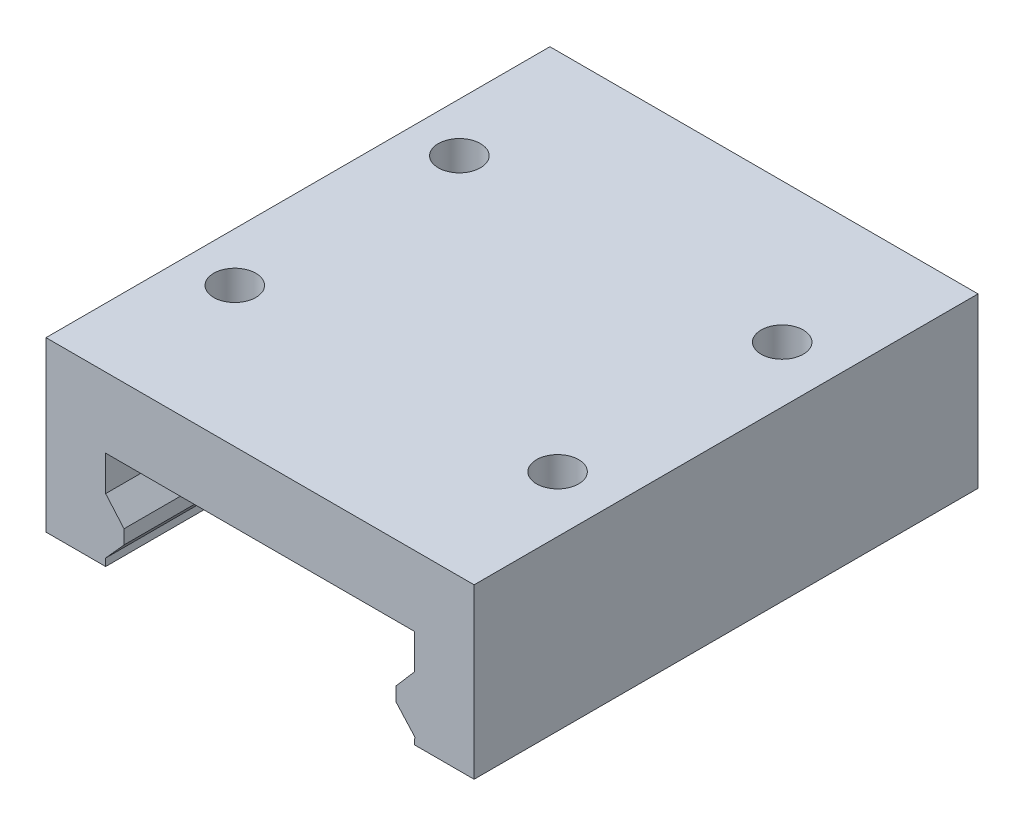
ISO-10303-21;
HEADER;
FILE_DESCRIPTION(('STEP AP214'),'2;1');
FILE_NAME('part.step','',(''),(''),'','','');
FILE_SCHEMA(('AUTOMOTIVE_DESIGN { 1 0 10303 214 1 1 1 1 }'));
ENDSEC;
DATA;
#1=APPLICATION_CONTEXT('core data for automotive mechanical design processes');
#2=APPLICATION_PROTOCOL_DEFINITION('international standard','automotive_design',2000,#1);
#3=PRODUCT_CONTEXT('',#1,'mechanical');
#4=PRODUCT('Part','Part','',(#3));
#5=PRODUCT_RELATED_PRODUCT_CATEGORY('part','',(#4));
#6=PRODUCT_DEFINITION_FORMATION('','',#4);
#7=PRODUCT_DEFINITION_CONTEXT('part definition',#1,'design');
#8=PRODUCT_DEFINITION('design','',#6,#7);
#9=PRODUCT_DEFINITION_SHAPE('','',#8);
#10=(LENGTH_UNIT() NAMED_UNIT(*) SI_UNIT(.MILLI.,.METRE.));
#11=(NAMED_UNIT(*) PLANE_ANGLE_UNIT() SI_UNIT($,.RADIAN.));
#12=(NAMED_UNIT(*) SI_UNIT($,.STERADIAN.) SOLID_ANGLE_UNIT());
#13=UNCERTAINTY_MEASURE_WITH_UNIT(LENGTH_MEASURE(1.E-05),#10,'distance_accuracy_value','');
#14=(GEOMETRIC_REPRESENTATION_CONTEXT(3) GLOBAL_UNCERTAINTY_ASSIGNED_CONTEXT((#13)) GLOBAL_UNIT_ASSIGNED_CONTEXT((#10,
#11,#12)) REPRESENTATION_CONTEXT('',''));
#15=CARTESIAN_POINT('',(0.,0.,0.));
#16=DIRECTION('',(0.,0.,1.));
#17=DIRECTION('',(1.,0.,0.));
#18=AXIS2_PLACEMENT_3D('',#15,#16,#17);
#19=CARTESIAN_POINT('',(0.,3.,71.8));
#20=DIRECTION('',(0.,-1.,0.));
#21=DIRECTION('',(0.,0.,-1.));
#22=AXIS2_PLACEMENT_3D('',#19,#20,#21);
#23=PLANE('',#22);
#24=DIRECTION('',(-1.,0.,0.));
#25=VECTOR('',#24,1.);
#26=CARTESIAN_POINT('',(0.,3.,0.));
#27=LINE('',#26,#25);
#28=CARTESIAN_POINT('',(-22.,3.,0.));
#29=VERTEX_POINT('',#28);
#30=CARTESIAN_POINT('',(-30.5,3.,0.));
#31=VERTEX_POINT('',#30);
#32=EDGE_CURVE('E372',#29,#31,#27,.T.);
#33=ORIENTED_EDGE('',*,*,#32,.F.);
#34=DIRECTION('',(0.,0.,-1.));
#35=VECTOR('',#34,1.);
#36=CARTESIAN_POINT('',(-22.,3.,71.8));
#37=LINE('',#36,#35);
#38=CARTESIAN_POINT('',(-22.,3.,71.8));
#39=VERTEX_POINT('',#38);
#40=EDGE_CURVE('E394',#39,#29,#37,.T.);
#41=ORIENTED_EDGE('',*,*,#40,.F.);
#42=DIRECTION('',(-1.,0.,0.));
#43=VECTOR('',#42,1.);
#44=CARTESIAN_POINT('',(0.,3.,71.8));
#45=LINE('',#44,#43);
#46=CARTESIAN_POINT('',(-30.5,3.,71.8));
#47=VERTEX_POINT('',#46);
#48=EDGE_CURVE('E438',#39,#47,#45,.T.);
#49=ORIENTED_EDGE('',*,*,#48,.T.);
#50=DIRECTION('',(0.,0.,-1.));
#51=VECTOR('',#50,1.);
#52=CARTESIAN_POINT('',(-30.5,3.,71.8));
#53=LINE('',#52,#51);
#54=EDGE_CURVE('E396',#47,#31,#53,.T.);
#55=ORIENTED_EDGE('',*,*,#54,.T.);
#56=EDGE_LOOP('',(#33,#41,#49,#55));
#57=FACE_BOUND('',#56,.T.);
#58=ADVANCED_FACE('F121',(#57),#23,.T.);
#59=CARTESIAN_POINT('',(0.,-36.1285275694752,0.));
#60=DIRECTION('',(0.,0.,1.));
#61=DIRECTION('',(1.,0.,0.));
#62=AXIS2_PLACEMENT_3D('',#59,#60,#61);
#63=PLANE('',#62);
#64=DIRECTION('',(0.,1.,0.));
#65=VECTOR('',#64,1.);
#66=CARTESIAN_POINT('',(-22.,-36.1285275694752,0.));
#67=LINE('',#66,#65);
#68=CARTESIAN_POINT('',(-22.,11.9999999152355,0.));
#69=VERTEX_POINT('',#68);
#70=CARTESIAN_POINT('',(-22.,16.9999999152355,0.));
#71=VERTEX_POINT('',#70);
#72=EDGE_CURVE('E254',#69,#71,#67,.T.);
#73=ORIENTED_EDGE('',*,*,#72,.F.);
#74=DIRECTION('',(-0.654424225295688,0.756127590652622,0.));
#75=VECTOR('',#74,1.);
#76=CARTESIAN_POINT('',(11.2373167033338,-26.4026924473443,0.));
#77=LINE('',#76,#75);
#78=CARTESIAN_POINT('',(-19.3823030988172,8.975489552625,0.));
#79=VERTEX_POINT('',#78);
#80=EDGE_CURVE('E381',#79,#69,#77,.T.);
#81=ORIENTED_EDGE('',*,*,#80,.F.);
#82=DIRECTION('',(0.,1.,0.));
#83=VECTOR('',#82,1.);
#84=CARTESIAN_POINT('',(-19.3823030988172,-36.1285275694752,0.));
#85=LINE('',#84,#83);
#86=CARTESIAN_POINT('',(-19.3823030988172,6.975489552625,0.));
#87=VERTEX_POINT('',#86);
#88=EDGE_CURVE('E379',#87,#79,#85,.T.);
#89=ORIENTED_EDGE('',*,*,#88,.F.);
#90=DIRECTION('',(0.66791595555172,0.744236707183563,0.));
#91=VECTOR('',#90,1.);
#92=CARTESIAN_POINT('',(-32.1621016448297,-7.26461821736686,0.));
#93=LINE('',#92,#91);
#94=CARTESIAN_POINT('',(-22.0539669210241,3.99854272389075,0.));
#95=VERTEX_POINT('',#94);
#96=EDGE_CURVE('E377',#95,#87,#93,.T.);
#97=ORIENTED_EDGE('',*,*,#96,.F.);
#98=DIRECTION('',(-0.0539669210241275,0.998542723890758,0.));
#99=VECTOR('',#98,1.);
#100=CARTESIAN_POINT('',(-19.8273576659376,-37.2001106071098,0.));
#101=LINE('',#100,#99);
#102=EDGE_CURVE('E375',#29,#95,#101,.T.);
#103=ORIENTED_EDGE('',*,*,#102,.F.);
#104=ORIENTED_EDGE('',*,*,#32,.T.);
#105=DIRECTION('',(0.,1.,0.));
#106=VECTOR('',#105,1.);
#107=CARTESIAN_POINT('',(-30.5,-36.1285275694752,0.));
#108=LINE('',#107,#106);
#109=CARTESIAN_POINT('',(-30.5,27.,0.));
#110=VERTEX_POINT('',#109);
#111=EDGE_CURVE('E369',#31,#110,#108,.T.);
#112=ORIENTED_EDGE('',*,*,#111,.T.);
#113=DIRECTION('',(1.,0.,0.));
#114=VECTOR('',#113,1.);
#115=CARTESIAN_POINT('',(0.,27.,0.));
#116=LINE('',#115,#114);
#117=CARTESIAN_POINT('',(30.5,27.,0.));
#118=VERTEX_POINT('',#117);
#119=EDGE_CURVE('E238',#110,#118,#116,.T.);
#120=ORIENTED_EDGE('',*,*,#119,.T.);
#121=DIRECTION('',(0.,1.,0.));
#122=VECTOR('',#121,1.);
#123=CARTESIAN_POINT('',(30.5,3.,0.));
#124=LINE('',#123,#122);
#125=CARTESIAN_POINT('',(30.5,3.,0.));
#126=VERTEX_POINT('',#125);
#127=EDGE_CURVE('E285',#126,#118,#124,.T.);
#128=ORIENTED_EDGE('',*,*,#127,.F.);
#129=DIRECTION('',(1.,0.,0.));
#130=VECTOR('',#129,1.);
#131=CARTESIAN_POINT('',(22.,3.,0.));
#132=LINE('',#131,#130);
#133=CARTESIAN_POINT('',(22.,3.,0.));
#134=VERTEX_POINT('',#133);
#135=EDGE_CURVE('E287',#134,#126,#132,.T.);
#136=ORIENTED_EDGE('',*,*,#135,.F.);
#137=DIRECTION('',(0.0539669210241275,0.998542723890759,0.));
#138=VECTOR('',#137,1.);
#139=CARTESIAN_POINT('',(22.,3.,0.));
#140=LINE('',#139,#138);
#141=CARTESIAN_POINT('',(22.0539669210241,3.99854272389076,0.));
#142=VERTEX_POINT('',#141);
#143=EDGE_CURVE('E290',#134,#142,#140,.T.);
#144=ORIENTED_EDGE('',*,*,#143,.T.);
#145=DIRECTION('',(-0.667915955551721,0.744236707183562,0.));
#146=VECTOR('',#145,1.);
#147=CARTESIAN_POINT('',(22.0539669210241,3.99854272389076,0.));
#148=LINE('',#147,#146);
#149=CARTESIAN_POINT('',(19.3823030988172,6.975489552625,0.));
#150=VERTEX_POINT('',#149);
#151=EDGE_CURVE('E293',#142,#150,#148,.T.);
#152=ORIENTED_EDGE('',*,*,#151,.T.);
#153=DIRECTION('',(0.,1.,0.));
#154=VECTOR('',#153,1.);
#155=CARTESIAN_POINT('',(19.3823030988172,6.975489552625,0.));
#156=LINE('',#155,#154);
#157=CARTESIAN_POINT('',(19.3823030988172,8.975489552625,0.));
#158=VERTEX_POINT('',#157);
#159=EDGE_CURVE('E296',#150,#158,#156,.T.);
#160=ORIENTED_EDGE('',*,*,#159,.T.);
#161=DIRECTION('',(0.654424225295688,0.756127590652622,0.));
#162=VECTOR('',#161,1.);
#163=CARTESIAN_POINT('',(19.3823030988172,8.975489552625,0.));
#164=LINE('',#163,#162);
#165=CARTESIAN_POINT('',(22.,11.9999999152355,0.));
#166=VERTEX_POINT('',#165);
#167=EDGE_CURVE('E249',#158,#166,#164,.T.);
#168=ORIENTED_EDGE('',*,*,#167,.T.);
#169=DIRECTION('',(0.,1.,0.));
#170=VECTOR('',#169,1.);
#171=CARTESIAN_POINT('',(22.,11.9999999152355,0.));
#172=LINE('',#171,#170);
#173=CARTESIAN_POINT('',(22.,16.9999999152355,0.));
#174=VERTEX_POINT('',#173);
#175=EDGE_CURVE('E243',#166,#174,#172,.T.);
#176=ORIENTED_EDGE('',*,*,#175,.T.);
#177=DIRECTION('',(-0.999999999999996,8.4764507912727E-08,0.));
#178=VECTOR('',#177,1.);
#179=CARTESIAN_POINT('',(22.,16.9999999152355,0.));
#180=LINE('',#179,#178);
#181=CARTESIAN_POINT('',(21.,17.,0.));
#182=VERTEX_POINT('',#181);
#183=EDGE_CURVE('E234',#174,#182,#180,.T.);
#184=ORIENTED_EDGE('',*,*,#183,.T.);
#185=DIRECTION('',(-1.,0.,0.));
#186=VECTOR('',#185,1.);
#187=CARTESIAN_POINT('',(0.,17.,0.));
#188=LINE('',#187,#186);
#189=CARTESIAN_POINT('',(-21.,17.,0.));
#190=VERTEX_POINT('',#189);
#191=EDGE_CURVE('E231',#182,#190,#188,.T.);
#192=ORIENTED_EDGE('',*,*,#191,.T.);
#193=DIRECTION('',(0.999999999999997,8.47645044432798E-08,0.));
#194=VECTOR('',#193,1.);
#195=CARTESIAN_POINT('',(-4.50341345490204E-06,17.0000017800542,0.));
#196=LINE('',#195,#194);
#197=EDGE_CURVE('E236',#71,#190,#196,.T.);
#198=ORIENTED_EDGE('',*,*,#197,.F.);
#199=EDGE_LOOP('',(#73,#81,#89,#97,#103,#104,#112,#120,#128,#136,#144,#152,#160,#168,#176,#184,
#192,#198));
#200=FACE_BOUND('',#199,.T.);
#201=ADVANCED_FACE('F241',(#200),#63,.F.);
#202=CARTESIAN_POINT('',(-19.8273576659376,-37.2001106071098,71.8));
#203=DIRECTION('',(-0.998542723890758,-0.0539669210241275,0.));
#204=DIRECTION('',(0.0539669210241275,-0.998542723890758,0.));
#205=AXIS2_PLACEMENT_3D('',#202,#203,#204);
#206=PLANE('',#205);
#207=ORIENTED_EDGE('',*,*,#102,.T.);
#208=DIRECTION('',(0.,0.,-1.));
#209=VECTOR('',#208,1.);
#210=CARTESIAN_POINT('',(-22.0539669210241,3.99854272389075,71.8));
#211=LINE('',#210,#209);
#212=CARTESIAN_POINT('',(-22.0539669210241,3.99854272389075,71.8));
#213=VERTEX_POINT('',#212);
#214=EDGE_CURVE('E391',#213,#95,#211,.T.);
#215=ORIENTED_EDGE('',*,*,#214,.F.);
#216=DIRECTION('',(-0.0539669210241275,0.998542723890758,0.));
#217=VECTOR('',#216,1.);
#218=CARTESIAN_POINT('',(-19.8273576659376,-37.2001106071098,71.8));
#219=LINE('',#218,#217);
#220=EDGE_CURVE('E440',#39,#213,#219,.T.);
#221=ORIENTED_EDGE('',*,*,#220,.F.);
#222=ORIENTED_EDGE('',*,*,#40,.T.);
#223=EDGE_LOOP('',(#207,#215,#221,#222));
#224=FACE_BOUND('',#223,.T.);
#225=ADVANCED_FACE('F324',(#224),#206,.F.);
#226=CARTESIAN_POINT('',(-32.1621016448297,-7.26461821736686,71.8));
#227=DIRECTION('',(-0.744236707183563,0.66791595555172,0.));
#228=DIRECTION('',(-0.66791595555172,-0.744236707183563,0.));
#229=AXIS2_PLACEMENT_3D('',#226,#227,#228);
#230=PLANE('',#229);
#231=ORIENTED_EDGE('',*,*,#96,.T.);
#232=DIRECTION('',(0.,0.,-1.));
#233=VECTOR('',#232,1.);
#234=CARTESIAN_POINT('',(-19.3823030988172,6.975489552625,71.8));
#235=LINE('',#234,#233);
#236=CARTESIAN_POINT('',(-19.3823030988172,6.975489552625,71.8));
#237=VERTEX_POINT('',#236);
#238=EDGE_CURVE('E388',#237,#87,#235,.T.);
#239=ORIENTED_EDGE('',*,*,#238,.F.);
#240=DIRECTION('',(0.66791595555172,0.744236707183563,0.));
#241=VECTOR('',#240,1.);
#242=CARTESIAN_POINT('',(-32.1621016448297,-7.26461821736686,71.8));
#243=LINE('',#242,#241);
#244=EDGE_CURVE('E446',#213,#237,#243,.T.);
#245=ORIENTED_EDGE('',*,*,#244,.F.);
#246=ORIENTED_EDGE('',*,*,#214,.T.);
#247=EDGE_LOOP('',(#231,#239,#245,#246));
#248=FACE_BOUND('',#247,.T.);
#249=ADVANCED_FACE('F330',(#248),#230,.F.);
#250=CARTESIAN_POINT('',(-19.3823030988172,-36.1285275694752,71.8));
#251=DIRECTION('',(-1.,0.,0.));
#252=DIRECTION('',(0.,0.,1.));
#253=AXIS2_PLACEMENT_3D('',#250,#251,#252);
#254=PLANE('',#253);
#255=ORIENTED_EDGE('',*,*,#88,.T.);
#256=DIRECTION('',(0.,0.,-1.));
#257=VECTOR('',#256,1.);
#258=CARTESIAN_POINT('',(-19.3823030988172,8.975489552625,71.8));
#259=LINE('',#258,#257);
#260=CARTESIAN_POINT('',(-19.3823030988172,8.975489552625,71.8));
#261=VERTEX_POINT('',#260);
#262=EDGE_CURVE('E385',#261,#79,#259,.T.);
#263=ORIENTED_EDGE('',*,*,#262,.F.);
#264=DIRECTION('',(0.,1.,0.));
#265=VECTOR('',#264,1.);
#266=CARTESIAN_POINT('',(-19.3823030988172,-36.1285275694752,71.8));
#267=LINE('',#266,#265);
#268=EDGE_CURVE('E448',#237,#261,#267,.T.);
#269=ORIENTED_EDGE('',*,*,#268,.F.);
#270=ORIENTED_EDGE('',*,*,#238,.T.);
#271=EDGE_LOOP('',(#255,#263,#269,#270));
#272=FACE_BOUND('',#271,.T.);
#273=ADVANCED_FACE('F341',(#272),#254,.F.);
#274=CARTESIAN_POINT('',(11.2373167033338,-26.4026924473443,71.8));
#275=DIRECTION('',(-0.756127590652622,-0.654424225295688,0.));
#276=DIRECTION('',(0.654424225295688,-0.756127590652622,0.));
#277=AXIS2_PLACEMENT_3D('',#274,#275,#276);
#278=PLANE('',#277);
#279=ORIENTED_EDGE('',*,*,#80,.T.);
#280=DIRECTION('',(0.,0.,-1.));
#281=VECTOR('',#280,1.);
#282=CARTESIAN_POINT('',(-22.,11.9999999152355,71.8));
#283=LINE('',#282,#281);
#284=CARTESIAN_POINT('',(-22.,11.9999999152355,71.8));
#285=VERTEX_POINT('',#284);
#286=EDGE_CURVE('E361',#285,#69,#283,.T.);
#287=ORIENTED_EDGE('',*,*,#286,.F.);
#288=DIRECTION('',(-0.654424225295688,0.756127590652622,0.));
#289=VECTOR('',#288,1.);
#290=CARTESIAN_POINT('',(11.2373167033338,-26.4026924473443,71.8));
#291=LINE('',#290,#289);
#292=EDGE_CURVE('E140',#261,#285,#291,.T.);
#293=ORIENTED_EDGE('',*,*,#292,.F.);
#294=ORIENTED_EDGE('',*,*,#262,.T.);
#295=EDGE_LOOP('',(#279,#287,#293,#294));
#296=FACE_BOUND('',#295,.T.);
#297=ADVANCED_FACE('F337',(#296),#278,.F.);
#298=CARTESIAN_POINT('',(-22.,-36.1285275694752,71.8));
#299=DIRECTION('',(-1.,0.,0.));
#300=DIRECTION('',(0.,0.,1.));
#301=AXIS2_PLACEMENT_3D('',#298,#299,#300);
#302=PLANE('',#301);
#303=ORIENTED_EDGE('',*,*,#72,.T.);
#304=DIRECTION('',(0.,0.,-1.));
#305=VECTOR('',#304,1.);
#306=CARTESIAN_POINT('',(-22.,16.9999999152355,71.8));
#307=LINE('',#306,#305);
#308=CARTESIAN_POINT('',(-22.,16.9999999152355,71.8));
#309=VERTEX_POINT('',#308);
#310=EDGE_CURVE('E12',#309,#71,#307,.T.);
#311=ORIENTED_EDGE('',*,*,#310,.F.);
#312=DIRECTION('',(0.,1.,0.));
#313=VECTOR('',#312,1.);
#314=CARTESIAN_POINT('',(-22.,-36.1285275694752,71.8));
#315=LINE('',#314,#313);
#316=EDGE_CURVE('E383',#285,#309,#315,.T.);
#317=ORIENTED_EDGE('',*,*,#316,.F.);
#318=ORIENTED_EDGE('',*,*,#286,.T.);
#319=EDGE_LOOP('',(#303,#311,#317,#318));
#320=FACE_BOUND('',#319,.T.);
#321=ADVANCED_FACE('F340',(#320),#302,.F.);
#322=CARTESIAN_POINT('',(0.,17.,71.8));
#323=DIRECTION('',(0.,-1.,0.));
#324=DIRECTION('',(1.,0.,0.));
#325=AXIS2_PLACEMENT_3D('',#322,#323,#324);
#326=PLANE('',#325);
#327=ORIENTED_EDGE('',*,*,#191,.F.);
#328=ORIENTED_EDGE('',*,*,#183,.F.);
#329=DIRECTION('',(0.,0.,-1.));
#330=VECTOR('',#329,1.);
#331=CARTESIAN_POINT('',(22.,16.9999999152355,71.8));
#332=LINE('',#331,#330);
#333=CARTESIAN_POINT('',(22.,16.9999999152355,71.8));
#334=VERTEX_POINT('',#333);
#335=EDGE_CURVE('E226',#334,#174,#332,.T.);
#336=ORIENTED_EDGE('',*,*,#335,.F.);
#337=DIRECTION('',(-0.999999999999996,8.4764507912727E-08,0.));
#338=VECTOR('',#337,1.);
#339=CARTESIAN_POINT('',(22.,16.9999999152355,71.8));
#340=LINE('',#339,#338);
#341=CARTESIAN_POINT('',(21.,17.,71.8));
#342=VERTEX_POINT('',#341);
#343=EDGE_CURVE('E272',#334,#342,#340,.T.);
#344=ORIENTED_EDGE('',*,*,#343,.T.);
#345=DIRECTION('',(-1.,0.,0.));
#346=VECTOR('',#345,1.);
#347=CARTESIAN_POINT('',(0.,17.,71.8));
#348=LINE('',#347,#346);
#349=CARTESIAN_POINT('',(-21.,17.,71.8));
#350=VERTEX_POINT('',#349);
#351=EDGE_CURVE('E435',#342,#350,#348,.T.);
#352=ORIENTED_EDGE('',*,*,#351,.T.);
#353=DIRECTION('',(0.999999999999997,8.47645044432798E-08,0.));
#354=VECTOR('',#353,1.);
#355=CARTESIAN_POINT('',(-4.50341345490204E-06,17.0000017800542,71.8));
#356=LINE('',#355,#354);
#357=EDGE_CURVE('E455',#309,#350,#356,.T.);
#358=ORIENTED_EDGE('',*,*,#357,.F.);
#359=ORIENTED_EDGE('',*,*,#310,.T.);
#360=ORIENTED_EDGE('',*,*,#197,.T.);
#361=EDGE_LOOP('',(#327,#328,#336,#344,#352,#358,#359,#360));
#362=FACE_BOUND('',#361,.T.);
#363=ADVANCED_FACE('F233',(#362),#326,.T.);
#364=CARTESIAN_POINT('',(0.,27.,71.8));
#365=DIRECTION('',(0.,1.,0.));
#366=DIRECTION('',(-1.,0.,0.));
#367=AXIS2_PLACEMENT_3D('',#364,#365,#366);
#368=PLANE('',#367);
#369=CARTESIAN_POINT('',(-23.5,27.,51.9));
#370=DIRECTION('',(0.,1.,0.));
#371=DIRECTION('',(-1.,0.,0.));
#372=AXIS2_PLACEMENT_3D('',#369,#370,#371);
#373=CIRCLE('',#372,3.);
#374=CARTESIAN_POINT('',(-26.5,27.,51.9));
#375=VERTEX_POINT('',#374);
#376=EDGE_CURVE('E491',#375,#375,#373,.T.);
#377=ORIENTED_EDGE('',*,*,#376,.F.);
#378=EDGE_LOOP('',(#377));
#379=FACE_BOUND('',#378,.T.);
#380=CARTESIAN_POINT('',(22.5,27.,51.9));
#381=DIRECTION('',(0.,1.,0.));
#382=DIRECTION('',(-1.,0.,0.));
#383=AXIS2_PLACEMENT_3D('',#380,#381,#382);
#384=CIRCLE('',#383,3.);
#385=CARTESIAN_POINT('',(19.5,27.,51.9));
#386=VERTEX_POINT('',#385);
#387=EDGE_CURVE('E485',#386,#386,#384,.T.);
#388=ORIENTED_EDGE('',*,*,#387,.F.);
#389=EDGE_LOOP('',(#388));
#390=FACE_BOUND('',#389,.T.);
#391=CARTESIAN_POINT('',(22.5,27.,19.9));
#392=DIRECTION('',(0.,1.,0.));
#393=DIRECTION('',(-1.,0.,0.));
#394=AXIS2_PLACEMENT_3D('',#391,#392,#393);
#395=CIRCLE('',#394,3.);
#396=CARTESIAN_POINT('',(19.5,27.,19.9));
#397=VERTEX_POINT('',#396);
#398=EDGE_CURVE('E479',#397,#397,#395,.T.);
#399=ORIENTED_EDGE('',*,*,#398,.F.);
#400=EDGE_LOOP('',(#399));
#401=FACE_BOUND('',#400,.T.);
#402=CARTESIAN_POINT('',(-23.5,27.,19.9));
#403=DIRECTION('',(0.,1.,0.));
#404=DIRECTION('',(-1.,0.,0.));
#405=AXIS2_PLACEMENT_3D('',#402,#403,#404);
#406=CIRCLE('',#405,3.);
#407=CARTESIAN_POINT('',(-26.5,27.,19.9));
#408=VERTEX_POINT('',#407);
#409=EDGE_CURVE('E459',#408,#408,#406,.T.);
#410=ORIENTED_EDGE('',*,*,#409,.F.);
#411=EDGE_LOOP('',(#410));
#412=FACE_BOUND('',#411,.T.);
#413=ORIENTED_EDGE('',*,*,#119,.F.);
#414=DIRECTION('',(0.,0.,-1.));
#415=VECTOR('',#414,1.);
#416=CARTESIAN_POINT('',(-30.5,27.,71.8));
#417=LINE('',#416,#415);
#418=CARTESIAN_POINT('',(-30.5,27.,71.8));
#419=VERTEX_POINT('',#418);
#420=EDGE_CURVE('E131',#419,#110,#417,.T.);
#421=ORIENTED_EDGE('',*,*,#420,.F.);
#422=DIRECTION('',(1.,0.,0.));
#423=VECTOR('',#422,1.);
#424=CARTESIAN_POINT('',(0.,27.,71.8));
#425=LINE('',#424,#423);
#426=CARTESIAN_POINT('',(30.5,27.,71.8));
#427=VERTEX_POINT('',#426);
#428=EDGE_CURVE('E426',#419,#427,#425,.T.);
#429=ORIENTED_EDGE('',*,*,#428,.T.);
#430=DIRECTION('',(0.,0.,-1.));
#431=VECTOR('',#430,1.);
#432=CARTESIAN_POINT('',(30.5,27.,71.8));
#433=LINE('',#432,#431);
#434=EDGE_CURVE('E125',#427,#118,#433,.T.);
#435=ORIENTED_EDGE('',*,*,#434,.T.);
#436=EDGE_LOOP('',(#413,#421,#429,#435));
#437=FACE_BOUND('',#436,.T.);
#438=ADVANCED_FACE('F320',(#379,#390,#401,#412,#437),#368,.T.);
#439=CARTESIAN_POINT('',(-30.5,-36.1285275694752,71.8));
#440=DIRECTION('',(-1.,0.,0.));
#441=DIRECTION('',(0.,0.,1.));
#442=AXIS2_PLACEMENT_3D('',#439,#440,#441);
#443=PLANE('',#442);
#444=ORIENTED_EDGE('',*,*,#111,.F.);
#445=ORIENTED_EDGE('',*,*,#54,.F.);
#446=DIRECTION('',(0.,1.,0.));
#447=VECTOR('',#446,1.);
#448=CARTESIAN_POINT('',(-30.5,-36.1285275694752,71.8));
#449=LINE('',#448,#447);
#450=EDGE_CURVE('E433',#47,#419,#449,.T.);
#451=ORIENTED_EDGE('',*,*,#450,.T.);
#452=ORIENTED_EDGE('',*,*,#420,.T.);
#453=EDGE_LOOP('',(#444,#445,#451,#452));
#454=FACE_BOUND('',#453,.T.);
#455=ADVANCED_FACE('F309',(#454),#443,.T.);
#456=CARTESIAN_POINT('',(0.,-36.1285275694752,71.8));
#457=DIRECTION('',(0.,0.,1.));
#458=DIRECTION('',(1.,0.,0.));
#459=AXIS2_PLACEMENT_3D('',#456,#457,#458);
#460=PLANE('',#459);
#461=ORIENTED_EDGE('',*,*,#316,.T.);
#462=ORIENTED_EDGE('',*,*,#357,.T.);
#463=ORIENTED_EDGE('',*,*,#351,.F.);
#464=ORIENTED_EDGE('',*,*,#343,.F.);
#465=DIRECTION('',(0.,1.,0.));
#466=VECTOR('',#465,1.);
#467=CARTESIAN_POINT('',(22.,11.9999999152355,71.8));
#468=LINE('',#467,#466);
#469=CARTESIAN_POINT('',(22.,11.9999999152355,71.8));
#470=VERTEX_POINT('',#469);
#471=EDGE_CURVE('E277',#470,#334,#468,.T.);
#472=ORIENTED_EDGE('',*,*,#471,.F.);
#473=DIRECTION('',(0.654424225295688,0.756127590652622,0.));
#474=VECTOR('',#473,1.);
#475=CARTESIAN_POINT('',(19.3823030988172,8.975489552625,71.8));
#476=LINE('',#475,#474);
#477=CARTESIAN_POINT('',(19.3823030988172,8.975489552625,71.8));
#478=VERTEX_POINT('',#477);
#479=EDGE_CURVE('E281',#478,#470,#476,.T.);
#480=ORIENTED_EDGE('',*,*,#479,.F.);
#481=DIRECTION('',(0.,1.,0.));
#482=VECTOR('',#481,1.);
#483=CARTESIAN_POINT('',(19.3823030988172,6.975489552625,71.8));
#484=LINE('',#483,#482);
#485=CARTESIAN_POINT('',(19.3823030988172,6.975489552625,71.8));
#486=VERTEX_POINT('',#485);
#487=EDGE_CURVE('E406',#486,#478,#484,.T.);
#488=ORIENTED_EDGE('',*,*,#487,.F.);
#489=DIRECTION('',(-0.667915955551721,0.744236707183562,0.));
#490=VECTOR('',#489,1.);
#491=CARTESIAN_POINT('',(22.0539669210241,3.99854272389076,71.8));
#492=LINE('',#491,#490);
#493=CARTESIAN_POINT('',(22.0539669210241,3.99854272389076,71.8));
#494=VERTEX_POINT('',#493);
#495=EDGE_CURVE('E403',#494,#486,#492,.T.);
#496=ORIENTED_EDGE('',*,*,#495,.F.);
#497=DIRECTION('',(0.0539669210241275,0.998542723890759,0.));
#498=VECTOR('',#497,1.);
#499=CARTESIAN_POINT('',(22.,3.,71.8));
#500=LINE('',#499,#498);
#501=CARTESIAN_POINT('',(22.,3.,71.8));
#502=VERTEX_POINT('',#501);
#503=EDGE_CURVE('E400',#502,#494,#500,.T.);
#504=ORIENTED_EDGE('',*,*,#503,.F.);
#505=DIRECTION('',(1.,0.,0.));
#506=VECTOR('',#505,1.);
#507=CARTESIAN_POINT('',(22.,3.,71.8));
#508=LINE('',#507,#506);
#509=CARTESIAN_POINT('',(30.5,3.,71.8));
#510=VERTEX_POINT('',#509);
#511=EDGE_CURVE('E247',#502,#510,#508,.T.);
#512=ORIENTED_EDGE('',*,*,#511,.T.);
#513=DIRECTION('',(0.,1.,0.));
#514=VECTOR('',#513,1.);
#515=CARTESIAN_POINT('',(30.5,3.,71.8));
#516=LINE('',#515,#514);
#517=EDGE_CURVE('E244',#510,#427,#516,.T.);
#518=ORIENTED_EDGE('',*,*,#517,.T.);
#519=ORIENTED_EDGE('',*,*,#428,.F.);
#520=ORIENTED_EDGE('',*,*,#450,.F.);
#521=ORIENTED_EDGE('',*,*,#48,.F.);
#522=ORIENTED_EDGE('',*,*,#220,.T.);
#523=ORIENTED_EDGE('',*,*,#244,.T.);
#524=ORIENTED_EDGE('',*,*,#268,.T.);
#525=ORIENTED_EDGE('',*,*,#292,.T.);
#526=EDGE_LOOP('',(#461,#462,#463,#464,#472,#480,#488,#496,#504,#512,#518,#519,#520,#521,#522,
#523,#524,#525));
#527=FACE_BOUND('',#526,.T.);
#528=ADVANCED_FACE('F307',(#527),#460,.T.);
#529=CARTESIAN_POINT('',(22.,11.9999999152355,71.8));
#530=DIRECTION('',(-1.,0.,0.));
#531=DIRECTION('',(0.,0.,1.));
#532=AXIS2_PLACEMENT_3D('',#529,#530,#531);
#533=PLANE('',#532);
#534=ORIENTED_EDGE('',*,*,#175,.F.);
#535=DIRECTION('',(0.,0.,-1.));
#536=VECTOR('',#535,1.);
#537=CARTESIAN_POINT('',(22.,11.9999999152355,71.8));
#538=LINE('',#537,#536);
#539=EDGE_CURVE('E255',#470,#166,#538,.T.);
#540=ORIENTED_EDGE('',*,*,#539,.F.);
#541=ORIENTED_EDGE('',*,*,#471,.T.);
#542=ORIENTED_EDGE('',*,*,#335,.T.);
#543=EDGE_LOOP('',(#534,#540,#541,#542));
#544=FACE_BOUND('',#543,.T.);
#545=ADVANCED_FACE('F305',(#544),#533,.T.);
#546=CARTESIAN_POINT('',(19.3823030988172,8.975489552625,71.8));
#547=DIRECTION('',(-0.756127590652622,0.654424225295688,0.));
#548=DIRECTION('',(-0.654424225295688,-0.756127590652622,0.));
#549=AXIS2_PLACEMENT_3D('',#546,#547,#548);
#550=PLANE('',#549);
#551=ORIENTED_EDGE('',*,*,#167,.F.);
#552=DIRECTION('',(0.,0.,-1.));
#553=VECTOR('',#552,1.);
#554=CARTESIAN_POINT('',(19.3823030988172,8.975489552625,71.8));
#555=LINE('',#554,#553);
#556=EDGE_CURVE('E257',#478,#158,#555,.T.);
#557=ORIENTED_EDGE('',*,*,#556,.F.);
#558=ORIENTED_EDGE('',*,*,#479,.T.);
#559=ORIENTED_EDGE('',*,*,#539,.T.);
#560=EDGE_LOOP('',(#551,#557,#558,#559));
#561=FACE_BOUND('',#560,.T.);
#562=ADVANCED_FACE('F301',(#561),#550,.T.);
#563=CARTESIAN_POINT('',(19.3823030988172,6.975489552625,71.8));
#564=DIRECTION('',(-1.,0.,0.));
#565=DIRECTION('',(0.,0.,1.));
#566=AXIS2_PLACEMENT_3D('',#563,#564,#565);
#567=PLANE('',#566);
#568=ORIENTED_EDGE('',*,*,#159,.F.);
#569=DIRECTION('',(0.,0.,-1.));
#570=VECTOR('',#569,1.);
#571=CARTESIAN_POINT('',(19.3823030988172,6.975489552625,71.8));
#572=LINE('',#571,#570);
#573=EDGE_CURVE('E259',#486,#150,#572,.T.);
#574=ORIENTED_EDGE('',*,*,#573,.F.);
#575=ORIENTED_EDGE('',*,*,#487,.T.);
#576=ORIENTED_EDGE('',*,*,#556,.T.);
#577=EDGE_LOOP('',(#568,#574,#575,#576));
#578=FACE_BOUND('',#577,.T.);
#579=ADVANCED_FACE('F314',(#578),#567,.T.);
#580=CARTESIAN_POINT('',(22.0539669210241,3.99854272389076,71.8));
#581=DIRECTION('',(-0.744236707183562,-0.667915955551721,0.));
#582=DIRECTION('',(0.667915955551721,-0.744236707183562,0.));
#583=AXIS2_PLACEMENT_3D('',#580,#581,#582);
#584=PLANE('',#583);
#585=ORIENTED_EDGE('',*,*,#151,.F.);
#586=DIRECTION('',(0.,0.,-1.));
#587=VECTOR('',#586,1.);
#588=CARTESIAN_POINT('',(22.0539669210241,3.99854272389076,71.8));
#589=LINE('',#588,#587);
#590=EDGE_CURVE('E261',#494,#142,#589,.T.);
#591=ORIENTED_EDGE('',*,*,#590,.F.);
#592=ORIENTED_EDGE('',*,*,#495,.T.);
#593=ORIENTED_EDGE('',*,*,#573,.T.);
#594=EDGE_LOOP('',(#585,#591,#592,#593));
#595=FACE_BOUND('',#594,.T.);
#596=ADVANCED_FACE('F414',(#595),#584,.T.);
#597=CARTESIAN_POINT('',(22.,3.,71.8));
#598=DIRECTION('',(-0.998542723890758,0.0539669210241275,0.));
#599=DIRECTION('',(-0.0539669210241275,-0.998542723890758,0.));
#600=AXIS2_PLACEMENT_3D('',#597,#598,#599);
#601=PLANE('',#600);
#602=ORIENTED_EDGE('',*,*,#143,.F.);
#603=DIRECTION('',(0.,0.,-1.));
#604=VECTOR('',#603,1.);
#605=CARTESIAN_POINT('',(22.,3.,71.8));
#606=LINE('',#605,#604);
#607=EDGE_CURVE('E263',#502,#134,#606,.T.);
#608=ORIENTED_EDGE('',*,*,#607,.F.);
#609=ORIENTED_EDGE('',*,*,#503,.T.);
#610=ORIENTED_EDGE('',*,*,#590,.T.);
#611=EDGE_LOOP('',(#602,#608,#609,#610));
#612=FACE_BOUND('',#611,.T.);
#613=ADVANCED_FACE('F417',(#612),#601,.T.);
#614=CARTESIAN_POINT('',(22.,3.,71.8));
#615=DIRECTION('',(0.,1.,0.));
#616=DIRECTION('',(-1.,0.,0.));
#617=AXIS2_PLACEMENT_3D('',#614,#615,#616);
#618=PLANE('',#617);
#619=ORIENTED_EDGE('',*,*,#135,.T.);
#620=DIRECTION('',(0.,0.,-1.));
#621=VECTOR('',#620,1.);
#622=CARTESIAN_POINT('',(30.5,3.,71.8));
#623=LINE('',#622,#621);
#624=EDGE_CURVE('E264',#510,#126,#623,.T.);
#625=ORIENTED_EDGE('',*,*,#624,.F.);
#626=ORIENTED_EDGE('',*,*,#511,.F.);
#627=ORIENTED_EDGE('',*,*,#607,.T.);
#628=EDGE_LOOP('',(#619,#625,#626,#627));
#629=FACE_BOUND('',#628,.T.);
#630=ADVANCED_FACE('F421',(#629),#618,.F.);
#631=CARTESIAN_POINT('',(30.5,3.,71.8));
#632=DIRECTION('',(-1.,0.,0.));
#633=DIRECTION('',(0.,-1.,0.));
#634=AXIS2_PLACEMENT_3D('',#631,#632,#633);
#635=PLANE('',#634);
#636=ORIENTED_EDGE('',*,*,#127,.T.);
#637=ORIENTED_EDGE('',*,*,#434,.F.);
#638=ORIENTED_EDGE('',*,*,#517,.F.);
#639=ORIENTED_EDGE('',*,*,#624,.T.);
#640=EDGE_LOOP('',(#636,#637,#638,#639));
#641=FACE_BOUND('',#640,.T.);
#642=ADVANCED_FACE('F123',(#641),#635,.F.);
#643=CARTESIAN_POINT('',(-23.5,21.,19.9));
#644=DIRECTION('',(0.,1.,0.));
#645=DIRECTION('',(-1.,0.,0.));
#646=AXIS2_PLACEMENT_3D('',#643,#644,#645);
#647=CYLINDRICAL_SURFACE('',#646,3.);
#648=CARTESIAN_POINT('',(-23.5,21.,19.9));
#649=DIRECTION('',(0.,1.,0.));
#650=DIRECTION('',(-1.,0.,0.));
#651=AXIS2_PLACEMENT_3D('',#648,#649,#650);
#652=CIRCLE('',#651,3.);
#653=CARTESIAN_POINT('',(-26.5,21.,19.9));
#654=VERTEX_POINT('',#653);
#655=EDGE_CURVE('E288',#654,#654,#652,.T.);
#656=ORIENTED_EDGE('',*,*,#655,.F.);
#657=EDGE_LOOP('',(#656));
#658=FACE_BOUND('',#657,.T.);
#659=ORIENTED_EDGE('',*,*,#409,.T.);
#660=EDGE_LOOP('',(#659));
#661=FACE_BOUND('',#660,.T.);
#662=ADVANCED_FACE('F317',(#658,#661),#647,.F.);
#663=CARTESIAN_POINT('',(-23.5,21.,19.9));
#664=DIRECTION('',(0.,1.,0.));
#665=DIRECTION('',(-1.,0.,0.));
#666=AXIS2_PLACEMENT_3D('',#663,#664,#665);
#667=PLANE('',#666);
#668=ORIENTED_EDGE('',*,*,#655,.T.);
#669=EDGE_LOOP('',(#668));
#670=FACE_BOUND('',#669,.T.);
#671=ADVANCED_FACE('F513',(#670),#667,.T.);
#672=CARTESIAN_POINT('',(22.5,21.,19.9));
#673=DIRECTION('',(0.,1.,0.));
#674=DIRECTION('',(-1.,0.,0.));
#675=AXIS2_PLACEMENT_3D('',#672,#673,#674);
#676=CYLINDRICAL_SURFACE('',#675,3.);
#677=CARTESIAN_POINT('',(22.5,21.,19.9));
#678=DIRECTION('',(0.,1.,0.));
#679=DIRECTION('',(-1.,0.,0.));
#680=AXIS2_PLACEMENT_3D('',#677,#678,#679);
#681=CIRCLE('',#680,3.);
#682=CARTESIAN_POINT('',(19.5,21.,19.9));
#683=VERTEX_POINT('',#682);
#684=EDGE_CURVE('E476',#683,#683,#681,.T.);
#685=ORIENTED_EDGE('',*,*,#684,.F.);
#686=EDGE_LOOP('',(#685));
#687=FACE_BOUND('',#686,.T.);
#688=ORIENTED_EDGE('',*,*,#398,.T.);
#689=EDGE_LOOP('',(#688));
#690=FACE_BOUND('',#689,.T.);
#691=ADVANCED_FACE('F519',(#687,#690),#676,.F.);
#692=CARTESIAN_POINT('',(22.5,21.,19.9));
#693=DIRECTION('',(0.,1.,0.));
#694=DIRECTION('',(-1.,0.,0.));
#695=AXIS2_PLACEMENT_3D('',#692,#693,#694);
#696=PLANE('',#695);
#697=ORIENTED_EDGE('',*,*,#684,.T.);
#698=EDGE_LOOP('',(#697));
#699=FACE_BOUND('',#698,.T.);
#700=ADVANCED_FACE('F526',(#699),#696,.T.);
#701=CARTESIAN_POINT('',(22.5,21.,51.9));
#702=DIRECTION('',(0.,1.,0.));
#703=DIRECTION('',(-1.,0.,0.));
#704=AXIS2_PLACEMENT_3D('',#701,#702,#703);
#705=CYLINDRICAL_SURFACE('',#704,3.);
#706=CARTESIAN_POINT('',(22.5,21.,51.9));
#707=DIRECTION('',(0.,1.,0.));
#708=DIRECTION('',(-1.,0.,0.));
#709=AXIS2_PLACEMENT_3D('',#706,#707,#708);
#710=CIRCLE('',#709,3.);
#711=CARTESIAN_POINT('',(19.5,21.,51.9));
#712=VERTEX_POINT('',#711);
#713=EDGE_CURVE('E482',#712,#712,#710,.T.);
#714=ORIENTED_EDGE('',*,*,#713,.F.);
#715=EDGE_LOOP('',(#714));
#716=FACE_BOUND('',#715,.T.);
#717=ORIENTED_EDGE('',*,*,#387,.T.);
#718=EDGE_LOOP('',(#717));
#719=FACE_BOUND('',#718,.T.);
#720=ADVANCED_FACE('F530',(#716,#719),#705,.F.);
#721=CARTESIAN_POINT('',(22.5,21.,51.9));
#722=DIRECTION('',(0.,1.,0.));
#723=DIRECTION('',(-1.,0.,0.));
#724=AXIS2_PLACEMENT_3D('',#721,#722,#723);
#725=PLANE('',#724);
#726=ORIENTED_EDGE('',*,*,#713,.T.);
#727=EDGE_LOOP('',(#726));
#728=FACE_BOUND('',#727,.T.);
#729=ADVANCED_FACE('F502',(#728),#725,.T.);
#730=CARTESIAN_POINT('',(-23.5,21.,51.9));
#731=DIRECTION('',(0.,1.,0.));
#732=DIRECTION('',(-1.,0.,0.));
#733=AXIS2_PLACEMENT_3D('',#730,#731,#732);
#734=CYLINDRICAL_SURFACE('',#733,3.);
#735=CARTESIAN_POINT('',(-23.5,21.,51.9));
#736=DIRECTION('',(0.,1.,0.));
#737=DIRECTION('',(-1.,0.,0.));
#738=AXIS2_PLACEMENT_3D('',#735,#736,#737);
#739=CIRCLE('',#738,3.);
#740=CARTESIAN_POINT('',(-26.5,21.,51.9));
#741=VERTEX_POINT('',#740);
#742=EDGE_CURVE('E488',#741,#741,#739,.T.);
#743=ORIENTED_EDGE('',*,*,#742,.F.);
#744=EDGE_LOOP('',(#743));
#745=FACE_BOUND('',#744,.T.);
#746=ORIENTED_EDGE('',*,*,#376,.T.);
#747=EDGE_LOOP('',(#746));
#748=FACE_BOUND('',#747,.T.);
#749=ADVANCED_FACE('F499',(#745,#748),#734,.F.);
#750=CARTESIAN_POINT('',(-23.5,21.,51.9));
#751=DIRECTION('',(0.,1.,0.));
#752=DIRECTION('',(-1.,0.,0.));
#753=AXIS2_PLACEMENT_3D('',#750,#751,#752);
#754=PLANE('',#753);
#755=ORIENTED_EDGE('',*,*,#742,.T.);
#756=EDGE_LOOP('',(#755));
#757=FACE_BOUND('',#756,.T.);
#758=ADVANCED_FACE('F497',(#757),#754,.T.);
#759=CLOSED_SHELL('',(#58,#201,#225,#249,#273,#297,#321,#363,#438,#455,#528,#545,#562,#579,#596,
#613,#630,#642,#662,#671,#691,#700,#720,#729,#749,#758));
#760=MANIFOLD_SOLID_BREP('B2',#759);
#761=ADVANCED_BREP_SHAPE_REPRESENTATION('',(#18,#760),#14);
#762=SHAPE_DEFINITION_REPRESENTATION(#9,#761);
ENDSEC;
END-ISO-10303-21;
